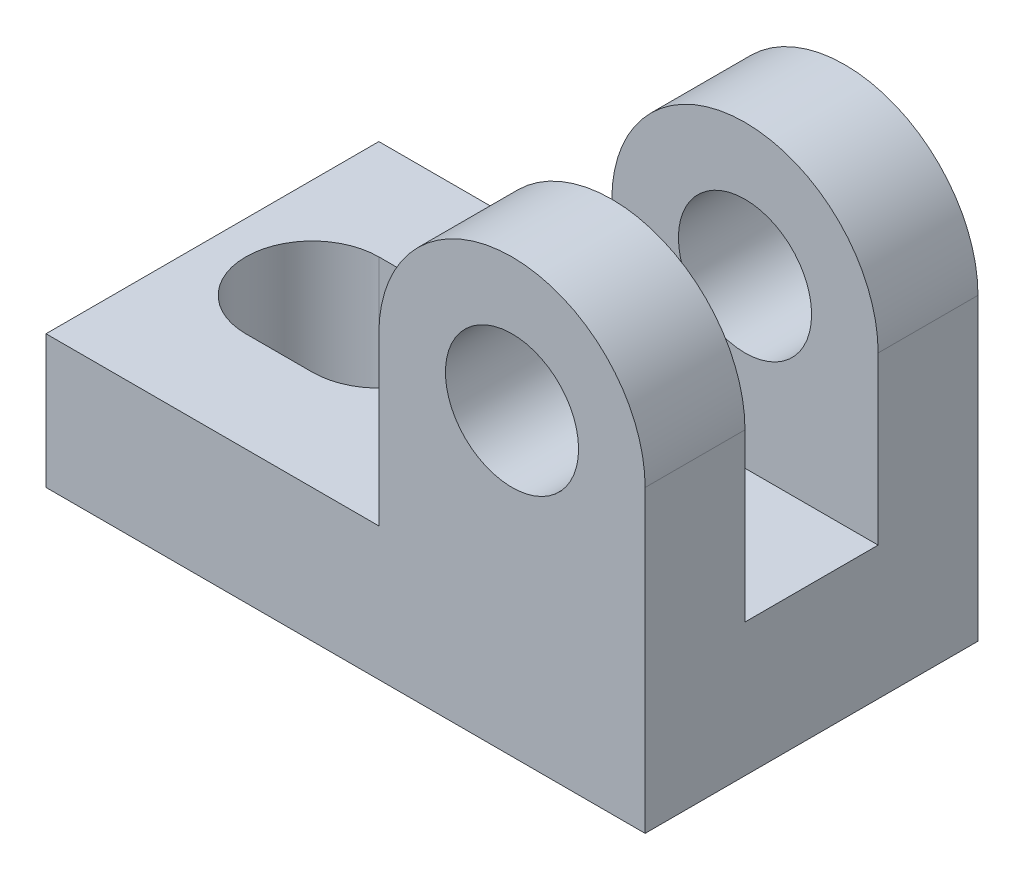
from build123d import *

# Parameters (mm, degrees)
SKETCH_1_W          = 90
SKETCH_1_H          = 50
EXTRUDE_1_DEPTH     = 20
CUT_EXTRUDE_1_DEPTH = 105.880884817
SKETCH_3_R          = 10
EXTRUDE_2_DEPTH     = 50
SKETCH_4_W          = 20
SKETCH_4_H          = 45
CUT_EXTRUDE_2_DEPTH = 122.757956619


with BuildPart() as part:
    # Sketch 1 → Extrude 1 (new body)
    with BuildSketch(Plane(origin=(0, 0, 0), x_dir=(1, 0, 0), z_dir=(0, 1, 0))):
        with Locations((45, 25)):
            Rectangle(SKETCH_1_W, SKETCH_1_H)
    extrude(amount=EXTRUDE_1_DEPTH)

    # Sketch 2 → Cut-Extrude 1 (cut, through all)
    with BuildSketch(Plane(origin=(0, 20, 0), x_dir=(1, 0, 0), z_dir=(0, 1, 0))):
        with BuildLine():
            Line((15, 15), (25, 15))
            ThreePointArc((25, 15), (35, 25), (25, 35))
            Line((25, 35), (15, 35))
            ThreePointArc((15, 35), (5, 25), (15, 15))
        make_face()
    extrude(amount=-CUT_EXTRUDE_1_DEPTH, mode=Mode.SUBTRACT)

    # Sketch 3 → Extrude 2 (add)
    with BuildSketch(Plane.XY):
        with BuildLine():
            Line((50, 20), (50, 45))
            ThreePointArc((50, 45), (70, 65), (90, 45))
            Line((90, 45), (90, 20))
            Line((90, 20), (50, 20))
        make_face()
        with Locations((70, 45)):
            Circle(SKETCH_3_R, mode=Mode.SUBTRACT)
    extrude(amount=-EXTRUDE_2_DEPTH)

    # Sketch 4 → Cut-Extrude 2 (cut, through all)
    with BuildSketch(Plane(origin=(90, 0, 0), x_dir=(0, 0, -1), z_dir=(1, 0, 0))):
        with Locations((25, 42.5)):
            Rectangle(SKETCH_4_W, SKETCH_4_H)
    extrude(amount=-CUT_EXTRUDE_2_DEPTH, mode=Mode.SUBTRACT)


solid = part.part
